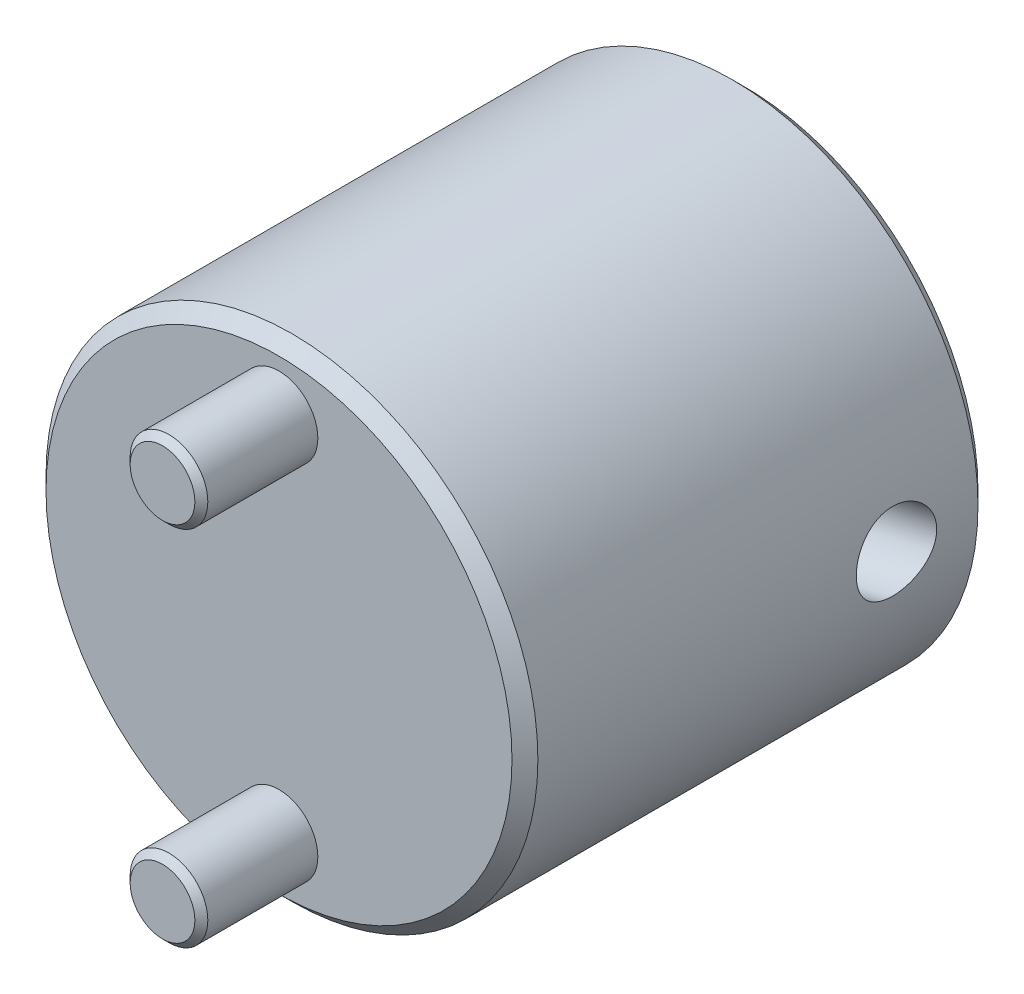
ISO-10303-21;
HEADER;
FILE_DESCRIPTION(('STEP AP214'),'2;1');
FILE_NAME('part.step','',(''),(''),'','','');
FILE_SCHEMA(('AUTOMOTIVE_DESIGN { 1 0 10303 214 1 1 1 1 }'));
ENDSEC;
DATA;
#1=APPLICATION_CONTEXT('core data for automotive mechanical design processes');
#2=APPLICATION_PROTOCOL_DEFINITION('international standard','automotive_design',2000,#1);
#3=PRODUCT_CONTEXT('',#1,'mechanical');
#4=PRODUCT('Part','Part','',(#3));
#5=PRODUCT_RELATED_PRODUCT_CATEGORY('part','',(#4));
#6=PRODUCT_DEFINITION_FORMATION('','',#4);
#7=PRODUCT_DEFINITION_CONTEXT('part definition',#1,'design');
#8=PRODUCT_DEFINITION('design','',#6,#7);
#9=PRODUCT_DEFINITION_SHAPE('','',#8);
#10=(LENGTH_UNIT() NAMED_UNIT(*) SI_UNIT(.MILLI.,.METRE.));
#11=(NAMED_UNIT(*) PLANE_ANGLE_UNIT() SI_UNIT($,.RADIAN.));
#12=(NAMED_UNIT(*) SI_UNIT($,.STERADIAN.) SOLID_ANGLE_UNIT());
#13=UNCERTAINTY_MEASURE_WITH_UNIT(LENGTH_MEASURE(1.E-05),#10,'distance_accuracy_value','');
#14=(GEOMETRIC_REPRESENTATION_CONTEXT(3) GLOBAL_UNCERTAINTY_ASSIGNED_CONTEXT((#13)) GLOBAL_UNIT_ASSIGNED_CONTEXT((#10,
#11,#12)) REPRESENTATION_CONTEXT('',''));
#15=CARTESIAN_POINT('',(0.,0.,0.));
#16=DIRECTION('',(0.,0.,1.));
#17=DIRECTION('',(1.,0.,0.));
#18=AXIS2_PLACEMENT_3D('',#15,#16,#17);
#19=CARTESIAN_POINT('',(0.,0.,9.));
#20=DIRECTION('',(0.,0.,1.));
#21=DIRECTION('',(1.,0.,0.));
#22=AXIS2_PLACEMENT_3D('',#19,#20,#21);
#23=PLANE('',#22);
#24=CARTESIAN_POINT('',(0.,14.,9.));
#25=DIRECTION('',(0.,0.,1.));
#26=DIRECTION('',(1.,0.,0.));
#27=AXIS2_PLACEMENT_3D('',#24,#25,#26);
#28=CIRCLE('',#27,2.49998893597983);
#29=CARTESIAN_POINT('',(2.49998893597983,14.,9.));
#30=VERTEX_POINT('',#29);
#31=EDGE_CURVE('E17',#30,#30,#28,.F.);
#32=ORIENTED_EDGE('',*,*,#31,.F.);
#33=EDGE_LOOP('',(#32));
#34=FACE_BOUND('',#33,.T.);
#35=ADVANCED_FACE('F14',(#34),#23,.T.);
#36=CARTESIAN_POINT('',(0.,0.,9.));
#37=DIRECTION('',(0.,0.,1.));
#38=DIRECTION('',(1.,0.,0.));
#39=AXIS2_PLACEMENT_3D('',#36,#37,#38);
#40=PLANE('',#39);
#41=CARTESIAN_POINT('',(0.,-14.,9.));
#42=DIRECTION('',(0.,0.,1.));
#43=DIRECTION('',(1.,0.,0.));
#44=AXIS2_PLACEMENT_3D('',#41,#42,#43);
#45=CIRCLE('',#44,2.49998893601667);
#46=CARTESIAN_POINT('',(2.49998893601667,-14.,9.));
#47=VERTEX_POINT('',#46);
#48=EDGE_CURVE('E114',#47,#47,#45,.F.);
#49=ORIENTED_EDGE('',*,*,#48,.F.);
#50=EDGE_LOOP('',(#49));
#51=FACE_BOUND('',#50,.T.);
#52=ADVANCED_FACE('F104',(#51),#40,.T.);
#53=CARTESIAN_POINT('',(3.764571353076,0.,-7.022225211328));
#54=DIRECTION('',(0.258819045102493,0.,0.965925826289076));
#55=DIRECTION('',(0.965925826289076,0.,-0.258819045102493));
#56=AXIS2_PLACEMENT_3D('',#53,#54,#55);
#57=PLANE('',#56);
#58=CARTESIAN_POINT('',(3.76457135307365,0.,-7.02222521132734));
#59=DIRECTION('',(0.258819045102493,0.,0.965925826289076));
#60=DIRECTION('',(0.965925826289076,0.,-0.258819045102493));
#61=AXIS2_PLACEMENT_3D('',#58,#59,#60);
#62=CIRCLE('',#61,10.);
#63=CARTESIAN_POINT('',(13.4238296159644,0.,-9.61041566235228));
#64=VERTEX_POINT('',#63);
#65=EDGE_CURVE('E116',#64,#64,#62,.F.);
#66=ORIENTED_EDGE('',*,*,#65,.T.);
#67=EDGE_LOOP('',(#66));
#68=FACE_BOUND('',#67,.T.);
#69=ADVANCED_FACE('F101',(#68),#57,.F.);
#70=CARTESIAN_POINT('',(0.,14.,8.49999144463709));
#71=DIRECTION('',(0.,0.,-1.));
#72=DIRECTION('',(-1.,0.,0.));
#73=AXIS2_PLACEMENT_3D('',#70,#71,#72);
#74=CONICAL_SURFACE('',#73,2.99999527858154,0.785395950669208);
#75=CARTESIAN_POINT('',(0.,14.,8.49998672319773));
#76=DIRECTION('',(0.,0.,-1.));
#77=DIRECTION('',(-1.,0.,0.));
#78=AXIS2_PLACEMENT_3D('',#75,#76,#77);
#79=CIRCLE('',#78,3.);
#80=CARTESIAN_POINT('',(-3.,14.,8.49998672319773));
#81=VERTEX_POINT('',#80);
#82=EDGE_CURVE('E118',#81,#81,#79,.T.);
#83=ORIENTED_EDGE('',*,*,#82,.F.);
#84=EDGE_LOOP('',(#83));
#85=FACE_BOUND('',#84,.T.);
#86=ORIENTED_EDGE('',*,*,#31,.T.);
#87=EDGE_LOOP('',(#86));
#88=FACE_BOUND('',#87,.T.);
#89=ADVANCED_FACE('F97',(#85,#88),#74,.T.);
#90=CARTESIAN_POINT('',(0.,-14.,8.49999144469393));
#91=DIRECTION('',(0.,0.,-1.));
#92=DIRECTION('',(-1.,0.,0.));
#93=AXIS2_PLACEMENT_3D('',#90,#91,#92);
#94=CONICAL_SURFACE('',#93,2.99999527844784,0.785395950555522);
#95=CARTESIAN_POINT('',(0.,-14.,8.49998672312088));
#96=DIRECTION('',(0.,0.,-1.));
#97=DIRECTION('',(-1.,0.,0.));
#98=AXIS2_PLACEMENT_3D('',#95,#96,#97);
#99=CIRCLE('',#98,3.);
#100=CARTESIAN_POINT('',(-3.,-14.,8.49998672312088));
#101=VERTEX_POINT('',#100);
#102=EDGE_CURVE('E123',#101,#101,#99,.T.);
#103=ORIENTED_EDGE('',*,*,#102,.F.);
#104=EDGE_LOOP('',(#103));
#105=FACE_BOUND('',#104,.T.);
#106=ORIENTED_EDGE('',*,*,#48,.T.);
#107=EDGE_LOOP('',(#106));
#108=FACE_BOUND('',#107,.T.);
#109=ADVANCED_FACE('F92',(#105,#108),#94,.T.);
#110=CARTESIAN_POINT('',(-7.817580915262,0.,-50.24740593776));
#111=DIRECTION('',(0.258819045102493,0.,0.965925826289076));
#112=DIRECTION('',(0.965925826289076,0.,-0.258819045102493));
#113=AXIS2_PLACEMENT_3D('',#110,#111,#112);
#114=CYLINDRICAL_SURFACE('',#113,10.);
#115=CARTESIAN_POINT('',(-4.00000000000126,0.,-36.));
#116=DIRECTION('',(0.,0.,-1.));
#117=DIRECTION('',(1.,0.,0.));
#118=AXIS2_PLACEMENT_3D('',#115,#116,#117);
#119=ELLIPSE('',#118,10.3527618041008,10.);
#120=CARTESIAN_POINT('',(6.35276180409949,0.,-36.));
#121=VERTEX_POINT('',#120);
#122=EDGE_CURVE('E79',#121,#121,#119,.F.);
#123=ORIENTED_EDGE('',*,*,#122,.F.);
#124=EDGE_LOOP('',(#123));
#125=FACE_BOUND('',#124,.T.);
#126=ORIENTED_EDGE('',*,*,#65,.F.);
#127=EDGE_LOOP('',(#126));
#128=FACE_BOUND('',#127,.T.);
#129=CARTESIAN_POINT('',(8.24744871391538,0.,-28.9289321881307));
#130=CARTESIAN_POINT('',(8.24744530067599,0.16436423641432,-28.9289220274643));
#131=CARTESIAN_POINT('',(8.24700357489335,0.328908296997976,-28.914764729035));
#132=CARTESIAN_POINT('',(8.24553188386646,0.653366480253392,-28.8586597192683));
#133=CARTESIAN_POINT('',(8.24450088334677,0.813271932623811,-28.8166630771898));
#134=CARTESIAN_POINT('',(8.24273088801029,1.12348315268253,-28.7066357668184));
#135=CARTESIAN_POINT('',(8.24199129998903,1.27380789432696,-28.6386585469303));
#136=CARTESIAN_POINT('',(8.24212053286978,1.56129290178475,-28.4791267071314));
#137=CARTESIAN_POINT('',(8.2429890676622,1.69845550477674,-28.3875762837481));
#138=CARTESIAN_POINT('',(8.2480224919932,1.95973946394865,-28.1811555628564));
#139=CARTESIAN_POINT('',(8.25227246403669,2.08342924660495,-28.065741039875));
#140=CARTESIAN_POINT('',(8.26608322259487,2.31049290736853,-27.8166435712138));
#141=CARTESIAN_POINT('',(8.27564519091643,2.41386225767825,-27.6829565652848));
#142=CARTESIAN_POINT('',(8.30223099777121,2.59960101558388,-27.3980038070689));
#143=CARTESIAN_POINT('',(8.31941758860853,2.68144668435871,-27.2464107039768));
#144=CARTESIAN_POINT('',(8.3628878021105,2.81842825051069,-26.9328144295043));
#145=CARTESIAN_POINT('',(8.3891691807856,2.87357072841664,-26.7708138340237));
#146=CARTESIAN_POINT('',(8.45077810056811,2.95403265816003,-26.4461794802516));
#147=CARTESIAN_POINT('',(8.48583175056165,2.98014390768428,-26.283690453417));
#148=CARTESIAN_POINT('',(8.56503701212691,3.00427461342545,-25.9588611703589));
#149=CARTESIAN_POINT('',(8.60918642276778,3.00230085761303,-25.7965208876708));
#150=CARTESIAN_POINT('',(8.70341728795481,2.9709395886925,-25.48275243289));
#151=CARTESIAN_POINT('',(8.75322706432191,2.94254427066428,-25.3311418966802));
#152=CARTESIAN_POINT('',(8.85781258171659,2.86074869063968,-25.0366406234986));
#153=CARTESIAN_POINT('',(8.91258883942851,2.80734582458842,-24.8937507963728));
#154=CARTESIAN_POINT('',(9.02512371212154,2.67631861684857,-24.6181167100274));
#155=CARTESIAN_POINT('',(9.08291294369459,2.59837186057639,-24.4855386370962));
#156=CARTESIAN_POINT('',(9.19760751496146,2.42069837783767,-24.2354532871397));
#157=CARTESIAN_POINT('',(9.25451269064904,2.32096766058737,-24.117948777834));
#158=CARTESIAN_POINT('',(9.36648870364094,2.09764727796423,-23.8957085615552));
#159=CARTESIAN_POINT('',(9.42138474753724,1.97323765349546,-23.7917074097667));
#160=CARTESIAN_POINT('',(9.52318743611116,1.70657662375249,-23.6046220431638));
#161=CARTESIAN_POINT('',(9.57009064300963,1.56431758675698,-23.5215468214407));
#162=CARTESIAN_POINT('',(9.65297105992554,1.26458300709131,-23.3777651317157));
#163=CARTESIAN_POINT('',(9.68886464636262,1.10700242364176,-23.3172291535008));
#164=CARTESIAN_POINT('',(9.74650103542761,0.782158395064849,-23.2211539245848));
#165=CARTESIAN_POINT('',(9.76827302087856,0.614915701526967,-23.1855631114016));
#166=CARTESIAN_POINT('',(9.78820464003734,0.371824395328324,-23.1530972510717));
#167=CARTESIAN_POINT('',(9.79275497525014,0.297737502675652,-23.1457094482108));
#168=CARTESIAN_POINT('',(9.79883597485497,0.149112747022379,-23.135847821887));
#169=CARTESIAN_POINT('',(9.80036663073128,0.074574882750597,-23.1333740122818));
#170=CARTESIAN_POINT('',(9.80035494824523,-0.164364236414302,-23.1333843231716));
#171=CARTESIAN_POINT('',(9.79289375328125,-0.328908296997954,-23.145424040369));
#172=CARTESIAN_POINT('',(9.76356672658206,-0.653366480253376,-23.1932765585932));
#173=CARTESIAN_POINT('',(9.74167553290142,-0.813271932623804,-23.229131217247));
#174=CARTESIAN_POINT('',(9.6851290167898,-1.12348315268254,-23.3235326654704));
#175=CARTESIAN_POINT('',(9.650499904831,-1.27380789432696,-23.3820328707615));
#176=CARTESIAN_POINT('',(9.5708459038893,-1.56129290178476,-23.5202561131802));
#177=CARTESIAN_POINT('',(9.52582286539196,-1.69845550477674,-23.5999753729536));
#178=CARTESIAN_POINT('',(9.42697157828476,-1.95973946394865,-23.7812576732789));
#179=CARTESIAN_POINT('',(9.3729449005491,-2.08342924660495,-23.8833345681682));
#180=CARTESIAN_POINT('',(9.26035663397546,-2.31049290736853,-24.1059646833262));
#181=CARTESIAN_POINT('',(9.20179403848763,-2.41386225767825,-24.2265220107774));
#182=CARTESIAN_POINT('',(9.08234164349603,-2.59960101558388,-24.4865912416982));
#183=CARTESIAN_POINT('',(9.02142911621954,-2.68144668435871,-24.6264680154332));
#184=CARTESIAN_POINT('',(8.90227728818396,-2.81842825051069,-24.9197854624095));
#185=CARTESIAN_POINT('',(8.84403733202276,-2.87357072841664,-25.0732227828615));
#186=CARTESIAN_POINT('',(8.73507504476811,-2.95403265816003,-25.3851688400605));
#187=CARTESIAN_POINT('',(8.68418788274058,-2.98014390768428,-25.5434152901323));
#188=CARTESIAN_POINT('',(8.59036700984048,-3.00427461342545,-25.8643283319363));
#189=CARTESIAN_POINT('',(8.54743137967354,-3.00230085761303,-26.0269938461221));
#190=CARTESIAN_POINT('',(8.47215347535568,-2.9709395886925,-26.3458407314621));
#191=CARTESIAN_POINT('',(8.43948473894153,-2.94254427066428,-26.5020441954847));
#192=CARTESIAN_POINT('',(8.38280781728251,-2.86074869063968,-26.8093825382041));
#193=CARTESIAN_POINT('',(8.35880053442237,-2.80734582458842,-26.9605168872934));
#194=CARTESIAN_POINT('',(8.31844154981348,-2.67631861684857,-27.255490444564));
#195=CARTESIAN_POINT('',(8.30219945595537,-2.59837186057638,-27.3992010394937));
#196=CARTESIAN_POINT('',(8.27648519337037,-2.42069837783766,-27.6731285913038));
#197=CARTESIAN_POINT('',(8.26701426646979,-2.32096766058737,-27.8033430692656));
#198=CARTESIAN_POINT('',(8.25286823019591,-2.09764727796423,-28.0517967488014));
#199=CARTESIAN_POINT('',(8.24840902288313,-1.97323765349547,-28.1693124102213));
#200=CARTESIAN_POINT('',(8.24303005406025,-1.7065766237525,-28.3822344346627));
#201=CARTESIAN_POINT('',(8.24211181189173,-1.56431758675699,-28.4776312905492));
#202=CARTESIAN_POINT('',(8.24199751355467,-1.26458300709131,-28.643590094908));
#203=CARTESIAN_POINT('',(8.24281428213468,-1.10700242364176,-28.7139625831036));
#204=CARTESIAN_POINT('',(8.24469124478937,-0.782158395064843,-28.8259843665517));
#205=CARTESIAN_POINT('',(8.2457509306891,-0.614915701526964,-28.8676929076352));
#206=CARTESIAN_POINT('',(8.24677928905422,-0.371824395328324,-28.905774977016));
#207=CARTESIAN_POINT('',(8.24702609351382,-0.297737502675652,-28.9144481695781));
#208=CARTESIAN_POINT('',(8.24736158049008,-0.149112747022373,-28.9260290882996));
#209=CARTESIAN_POINT('',(8.24745026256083,-0.0745748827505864,-28.9289367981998));
#210=CARTESIAN_POINT('',(8.24744871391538,0.,-28.9289321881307));
#211=B_SPLINE_CURVE_WITH_KNOTS('',3,(#129,#130,#131,#132,#133,#134,#135,#136,#137,#138,#139,
#140,#141,#142,#143,#144,#145,#146,#147,#148,#149,#150,#151,#152,#153,#154,#155,#156,#157,#158,
#159,#160,#161,#162,#163,#164,#165,#166,#167,#168,#169,#170,#171,#172,#173,#174,#175,#176,#177,
#178,#179,#180,#181,#182,#183,#184,#185,#186,#187,#188,#189,#190,#191,#192,#193,#194,#195,#196,
#197,#198,#199,#200,#201,#202,#203,#204,#205,#206,#207,#208,#209,#210),.UNSPECIFIED.,.T.,.F.,(4,
2,2,2,2,2,2,2,2,2,2,2,2,2,2,2,2,2,2,2,2,2,2,2,2,2,2,2,2,2,2,2,2,2,2,2,2,2,2,2,4),(0.,
0.49280574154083,0.986479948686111,1.47914396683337,1.97172034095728,2.47709830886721,
2.98258875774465,3.49943124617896,4.01614630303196,4.51839363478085,5.02051957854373,
5.50451902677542,5.98856888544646,6.47926306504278,6.97004721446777,7.48124851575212,
7.99266913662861,8.507883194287,9.02202912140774,9.2456229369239,9.46921738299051,
9.96202312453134,10.4556973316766,10.9483613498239,11.4409377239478,11.9463156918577,
12.4518061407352,12.9686486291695,13.4853636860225,13.9876110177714,14.4897369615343,
14.9737364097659,15.457786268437,15.9484804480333,16.4392645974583,16.9504658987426,
17.4618865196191,17.9771005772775,18.4912465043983,18.7148403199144,18.938434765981),.UNSPECIFIED.);
#212=CARTESIAN_POINT('',(8.24744871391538,0.,-28.9289321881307));
#213=VERTEX_POINT('',#212);
#214=EDGE_CURVE('E76',#213,#213,#211,.T.);
#215=ORIENTED_EDGE('',*,*,#214,.T.);
#216=EDGE_LOOP('',(#215));
#217=FACE_BOUND('',#216,.T.);
#218=ADVANCED_FACE('F86',(#125,#128,#217),#114,.F.);
#219=CARTESIAN_POINT('',(0.,14.,0.));
#220=DIRECTION('',(0.,0.,1.));
#221=DIRECTION('',(1.,0.,0.));
#222=AXIS2_PLACEMENT_3D('',#219,#220,#221);
#223=CYLINDRICAL_SURFACE('',#222,3.);
#224=CARTESIAN_POINT('',(0.,14.,0.));
#225=DIRECTION('',(0.,0.,1.));
#226=DIRECTION('',(1.,0.,0.));
#227=AXIS2_PLACEMENT_3D('',#224,#225,#226);
#228=CIRCLE('',#227,3.);
#229=CARTESIAN_POINT('',(3.,14.,0.));
#230=VERTEX_POINT('',#229);
#231=EDGE_CURVE('E72',#230,#230,#228,.T.);
#232=ORIENTED_EDGE('',*,*,#231,.T.);
#233=EDGE_LOOP('',(#232));
#234=FACE_BOUND('',#233,.T.);
#235=ORIENTED_EDGE('',*,*,#82,.T.);
#236=EDGE_LOOP('',(#235));
#237=FACE_BOUND('',#236,.T.);
#238=ADVANCED_FACE('F91',(#234,#237),#223,.T.);
#239=CARTESIAN_POINT('',(0.,-14.,0.));
#240=DIRECTION('',(0.,0.,1.));
#241=DIRECTION('',(1.,0.,0.));
#242=AXIS2_PLACEMENT_3D('',#239,#240,#241);
#243=CYLINDRICAL_SURFACE('',#242,3.);
#244=CARTESIAN_POINT('',(0.,-14.,0.));
#245=DIRECTION('',(0.,0.,1.));
#246=DIRECTION('',(1.,0.,0.));
#247=AXIS2_PLACEMENT_3D('',#244,#245,#246);
#248=CIRCLE('',#247,3.);
#249=CARTESIAN_POINT('',(3.,-14.,0.));
#250=VERTEX_POINT('',#249);
#251=EDGE_CURVE('E68',#250,#250,#248,.T.);
#252=ORIENTED_EDGE('',*,*,#251,.T.);
#253=EDGE_LOOP('',(#252));
#254=FACE_BOUND('',#253,.T.);
#255=ORIENTED_EDGE('',*,*,#102,.T.);
#256=EDGE_LOOP('',(#255));
#257=FACE_BOUND('',#256,.T.);
#258=ADVANCED_FACE('F139',(#254,#257),#243,.T.);
#259=CARTESIAN_POINT('',(0.,0.,-36.));
#260=DIRECTION('',(0.,0.,-1.));
#261=DIRECTION('',(-1.,0.,0.));
#262=AXIS2_PLACEMENT_3D('',#259,#260,#261);
#263=PLANE('',#262);
#264=ORIENTED_EDGE('',*,*,#122,.T.);
#265=EDGE_LOOP('',(#264));
#266=FACE_BOUND('',#265,.T.);
#267=CARTESIAN_POINT('',(0.,0.,-36.));
#268=DIRECTION('',(0.,0.,-1.));
#269=DIRECTION('',(-1.,0.,0.));
#270=AXIS2_PLACEMENT_3D('',#267,#268,#269);
#271=CIRCLE('',#270,17.9999935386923);
#272=CARTESIAN_POINT('',(-17.9999935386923,0.,-36.));
#273=VERTEX_POINT('',#272);
#274=EDGE_CURVE('E38',#273,#273,#271,.F.);
#275=ORIENTED_EDGE('',*,*,#274,.F.);
#276=EDGE_LOOP('',(#275));
#277=FACE_BOUND('',#276,.T.);
#278=ADVANCED_FACE('F63',(#266,#277),#263,.T.);
#279=CARTESIAN_POINT('',(-5.899648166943,0.,-22.03240046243));
#280=DIRECTION('',(0.965925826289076,0.,-0.258819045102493));
#281=DIRECTION('',(-0.258819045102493,0.,-0.965925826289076));
#282=AXIS2_PLACEMENT_3D('',#279,#280,#281);
#283=CYLINDRICAL_SURFACE('',#282,3.);
#284=ORIENTED_EDGE('',*,*,#214,.F.);
#285=EDGE_LOOP('',(#284));
#286=FACE_BOUND('',#285,.T.);
#287=CARTESIAN_POINT('',(19.,0.,-25.5984125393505));
#288=CARTESIAN_POINT('',(18.9999969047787,0.167403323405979,-25.5984196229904));
#289=CARTESIAN_POINT('',(18.9977630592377,0.335008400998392,-25.612377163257));
#290=CARTESIAN_POINT('',(18.9890583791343,0.665690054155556,-25.6679195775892));
#291=CARTESIAN_POINT('',(18.982579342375,0.828757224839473,-25.7095579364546));
#292=CARTESIAN_POINT('',(18.9661054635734,1.14540627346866,-25.8193796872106));
#293=CARTESIAN_POINT('',(18.9561131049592,1.29899476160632,-25.8875443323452));
#294=CARTESIAN_POINT('',(18.9337295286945,1.59234146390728,-26.0485681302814));
#295=CARTESIAN_POINT('',(18.9213393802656,1.73210580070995,-26.1414162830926));
#296=CARTESIAN_POINT('',(18.8955514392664,1.99385296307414,-26.3492056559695));
#297=CARTESIAN_POINT('',(18.8821543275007,2.11584764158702,-26.4641320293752));
#298=CARTESIAN_POINT('',(18.8558383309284,2.33880275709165,-26.7128902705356));
#299=CARTESIAN_POINT('',(18.8429194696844,2.43976215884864,-26.8467230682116));
#300=CARTESIAN_POINT('',(18.8189581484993,2.61819933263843,-27.129762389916));
#301=CARTESIAN_POINT('',(18.8079197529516,2.69562651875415,-27.2790011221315));
#302=CARTESIAN_POINT('',(18.7889355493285,2.82492340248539,-27.5883331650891));
#303=CARTESIAN_POINT('',(18.7809898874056,2.8767918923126,-27.748426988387));
#304=CARTESIAN_POINT('',(18.7688938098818,2.95469464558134,-28.0776267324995));
#305=CARTESIAN_POINT('',(18.7648064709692,2.98030011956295,-28.2468361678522));
#306=CARTESIAN_POINT('',(18.7610078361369,3.00411803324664,-28.5872107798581));
#307=CARTESIAN_POINT('',(18.7612973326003,3.0023255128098,-28.7583763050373));
#308=CARTESIAN_POINT('',(18.7662208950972,2.97139828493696,-29.1042359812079));
#309=CARTESIAN_POINT('',(18.7710077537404,2.94130195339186,-29.2788418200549));
#310=CARTESIAN_POINT('',(18.7845425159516,2.85357888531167,-29.620847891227));
#311=CARTESIAN_POINT('',(18.7932914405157,2.79594505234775,-29.7882462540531));
#312=CARTESIAN_POINT('',(18.8141342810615,2.65213129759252,-30.1173811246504));
#313=CARTESIAN_POINT('',(18.8263377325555,2.56499432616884,-30.278693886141));
#314=CARTESIAN_POINT('',(18.8525130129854,2.36493533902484,-30.5842893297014));
#315=CARTESIAN_POINT('',(18.866484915,2.2520122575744,-30.7285713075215));
#316=CARTESIAN_POINT('',(18.894533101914,2.00304576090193,-30.9952876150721));
#317=CARTESIAN_POINT('',(18.9086091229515,1.86704892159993,-31.117764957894));
#318=CARTESIAN_POINT('',(18.9285076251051,1.64832999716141,-31.2817460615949));
#319=CARTESIAN_POINT('',(18.9349419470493,1.57291180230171,-31.3331463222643));
#320=CARTESIAN_POINT('',(18.9471975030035,1.41765849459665,-31.4288325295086));
#321=CARTESIAN_POINT('',(18.9530190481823,1.33782565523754,-31.4731220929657));
#322=CARTESIAN_POINT('',(18.9635405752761,1.17902317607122,-31.5517419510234));
#323=CARTESIAN_POINT('',(18.9682857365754,1.10026669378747,-31.5864977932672));
#324=CARTESIAN_POINT('',(18.9769052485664,0.939949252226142,-31.6488178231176));
#325=CARTESIAN_POINT('',(18.9807800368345,0.858389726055,-31.6763856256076));
#326=CARTESIAN_POINT('',(18.9875277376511,0.693256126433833,-31.7239563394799));
#327=CARTESIAN_POINT('',(18.9904029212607,0.609687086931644,-31.7439764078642));
#328=CARTESIAN_POINT('',(18.9950666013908,0.441076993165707,-31.7762731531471));
#329=CARTESIAN_POINT('',(18.9968557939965,0.356036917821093,-31.7885547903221));
#330=CARTESIAN_POINT('',(18.9987131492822,0.225661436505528,-31.8012786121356));
#331=CARTESIAN_POINT('',(18.9991950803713,0.180594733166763,-31.8045732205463));
#332=CARTESIAN_POINT('',(18.9998389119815,0.0903584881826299,-31.808970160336));
#333=CARTESIAN_POINT('',(19.0000008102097,0.0451889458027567,-31.8100724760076));
#334=CARTESIAN_POINT('',(18.9999971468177,-0.15913449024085,-31.8100595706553));
#335=CARTESIAN_POINT('',(18.9979765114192,-0.318509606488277,-31.796344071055));
#336=CARTESIAN_POINT('',(18.9901155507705,-0.632732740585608,-31.742042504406));
#337=CARTESIAN_POINT('',(18.9842665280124,-0.787569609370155,-31.7013952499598));
#338=CARTESIAN_POINT('',(18.9694319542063,-1.08773614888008,-31.5951397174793));
#339=CARTESIAN_POINT('',(18.9604556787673,-1.23309244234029,-31.529605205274));
#340=CARTESIAN_POINT('',(18.940323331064,-1.51116527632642,-31.3761513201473));
#341=CARTESIAN_POINT('',(18.9291678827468,-1.64388541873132,-31.2882383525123));
#342=CARTESIAN_POINT('',(18.905305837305,-1.89908311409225,-31.088960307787));
#343=CARTESIAN_POINT('',(18.8925545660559,-2.02092324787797,-30.9767858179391));
#344=CARTESIAN_POINT('',(18.8671708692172,-2.24558997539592,-30.734765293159));
#345=CARTESIAN_POINT('',(18.8545384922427,-2.34840908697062,-30.6049123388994));
#346=CARTESIAN_POINT('',(18.8297428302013,-2.53984120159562,-30.320952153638));
#347=CARTESIAN_POINT('',(18.8176809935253,-2.62687066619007,-30.1657666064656));
#348=CARTESIAN_POINT('',(18.7964299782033,-2.77485644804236,-29.8432204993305));
#349=CARTESIAN_POINT('',(18.7872415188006,-2.83580623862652,-29.6758569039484));
#350=CARTESIAN_POINT('',(18.7725277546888,-2.93166609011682,-29.3271949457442));
#351=CARTESIAN_POINT('',(18.7671446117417,-2.96557112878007,-29.1456125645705));
#352=CARTESIAN_POINT('',(18.761316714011,-3.00222499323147,-28.7792346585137));
#353=CARTESIAN_POINT('',(18.7608715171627,-3.00497660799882,-28.5944394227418));
#354=CARTESIAN_POINT('',(18.765046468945,-2.97879139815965,-28.23039802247));
#355=CARTESIAN_POINT('',(18.7695778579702,-2.9504098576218,-28.051111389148));
#356=CARTESIAN_POINT('',(18.7831129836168,-2.86297217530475,-27.7003511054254));
#357=CARTESIAN_POINT('',(18.7921156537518,-2.80392334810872,-27.5288756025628));
#358=CARTESIAN_POINT('',(18.8130991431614,-2.65939364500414,-27.2059597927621));
#359=CARTESIAN_POINT('',(18.8249452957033,-2.57507410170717,-27.0539905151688));
#360=CARTESIAN_POINT('',(18.8504098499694,-2.3814987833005,-26.7670471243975));
#361=CARTESIAN_POINT('',(18.8640278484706,-2.27224867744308,-26.6320691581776));
#362=CARTESIAN_POINT('',(18.891050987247,-2.03519079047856,-26.3866043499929));
#363=CARTESIAN_POINT('',(18.904451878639,-1.90796690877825,-26.2755524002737));
#364=CARTESIAN_POINT('',(18.929892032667,-1.63638363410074,-26.0765246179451));
#365=CARTESIAN_POINT('',(18.9419307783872,-1.49201777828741,-25.9885575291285));
#366=CARTESIAN_POINT('',(18.9632048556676,-1.19139303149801,-25.8386976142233));
#367=CARTESIAN_POINT('',(18.9724583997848,-1.03522014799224,-25.7766343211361));
#368=CARTESIAN_POINT('',(18.9872251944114,-0.714757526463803,-25.6794636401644));
#369=CARTESIAN_POINT('',(18.992745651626,-0.550484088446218,-25.6443042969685));
#370=CARTESIAN_POINT('',(18.9973992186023,-0.320831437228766,-25.6148070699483));
#371=CARTESIAN_POINT('',(18.998372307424,-0.256831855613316,-25.6086637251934));
#372=CARTESIAN_POINT('',(18.9996732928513,-0.128564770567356,-25.6004650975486));
#373=CARTESIAN_POINT('',(19.0000011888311,-0.0642972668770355,-25.5984098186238));
#374=CARTESIAN_POINT('',(19.,0.,-25.5984125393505));
#375=B_SPLINE_CURVE_WITH_KNOTS('',3,(#287,#288,#289,#290,#291,#292,#293,#294,#295,#296,#297,
#298,#299,#300,#301,#302,#303,#304,#305,#306,#307,#308,#309,#310,#311,#312,#313,#314,#315,#316,
#317,#318,#319,#320,#321,#322,#323,#324,#325,#326,#327,#328,#329,#330,#331,#332,#333,#334,#335,
#336,#337,#338,#339,#340,#341,#342,#343,#344,#345,#346,#347,#348,#349,#350,#351,#352,#353,#354,
#355,#356,#357,#358,#359,#360,#361,#362,#363,#364,#365,#366,#367,#368,#369,#370,#371,#372,#373,
#374),.UNSPECIFIED.,.T.,.F.,(4,2,2,2,2,2,2,2,2,2,2,2,2,2,2,2,2,2,2,2,2,2,2,2,2,2,2,2,2,2,2,2,2,
2,2,2,2,2,2,2,2,2,2,4),(0.,0.501968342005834,1.00490941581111,1.50749569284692,2.00985837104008,
2.51188440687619,3.01393514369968,3.51705760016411,4.02020382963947,4.53143998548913,
5.04276869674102,5.5721224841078,6.10161275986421,6.65025335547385,7.19891663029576,
7.74648528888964,8.02065360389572,8.29468201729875,8.55299192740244,8.81117168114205,
9.06876096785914,9.3261849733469,9.46170177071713,9.59721953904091,10.074450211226,
10.5527688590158,11.0296806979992,11.5064561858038,12.0026522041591,12.499042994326,
13.0316460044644,13.5643822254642,14.1160972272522,14.6677628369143,15.2097467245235,
15.7516014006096,16.2716155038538,16.7915114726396,17.297302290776,17.8032844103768,
18.3058821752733,18.8075068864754,19.0003056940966,19.1931046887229),.UNSPECIFIED.);
#376=CARTESIAN_POINT('',(19.,0.,-25.5984125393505));
#377=VERTEX_POINT('',#376);
#378=EDGE_CURVE('E31',#377,#377,#375,.T.);
#379=ORIENTED_EDGE('',*,*,#378,.F.);
#380=EDGE_LOOP('',(#379));
#381=FACE_BOUND('',#380,.T.);
#382=ADVANCED_FACE('F40',(#286,#381),#283,.F.);
#383=CARTESIAN_POINT('',(0.,0.,0.));
#384=DIRECTION('',(0.,0.,-1.));
#385=DIRECTION('',(-1.,0.,0.));
#386=AXIS2_PLACEMENT_3D('',#383,#384,#385);
#387=PLANE('',#386);
#388=ORIENTED_EDGE('',*,*,#251,.F.);
#389=EDGE_LOOP('',(#388));
#390=FACE_BOUND('',#389,.T.);
#391=ORIENTED_EDGE('',*,*,#231,.F.);
#392=EDGE_LOOP('',(#391));
#393=FACE_BOUND('',#392,.T.);
#394=CARTESIAN_POINT('',(0.,0.,0.));
#395=DIRECTION('',(0.,0.,-1.));
#396=DIRECTION('',(-1.,0.,0.));
#397=AXIS2_PLACEMENT_3D('',#394,#395,#396);
#398=CIRCLE('',#397,17.9999934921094);
#399=CARTESIAN_POINT('',(-17.9999934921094,0.,0.));
#400=VERTEX_POINT('',#399);
#401=EDGE_CURVE('E26',#400,#400,#398,.T.);
#402=ORIENTED_EDGE('',*,*,#401,.F.);
#403=EDGE_LOOP('',(#402));
#404=FACE_BOUND('',#403,.T.);
#405=ADVANCED_FACE('F55',(#390,#393,#404),#387,.F.);
#406=CARTESIAN_POINT('',(0.,0.,-34.99999620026));
#407=DIRECTION('',(0.,0.,1.));
#408=DIRECTION('',(1.,0.,0.));
#409=AXIS2_PLACEMENT_3D('',#406,#407,#408);
#410=CONICAL_SURFACE('',#409,18.9999969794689,0.785397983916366);
#411=ORIENTED_EDGE('',*,*,#274,.T.);
#412=EDGE_LOOP('',(#411));
#413=FACE_BOUND('',#412,.T.);
#414=CARTESIAN_POINT('',(0.,0.,-34.99999922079));
#415=DIRECTION('',(0.,0.,-1.));
#416=DIRECTION('',(-1.,0.,0.));
#417=AXIS2_PLACEMENT_3D('',#414,#415,#416);
#418=CIRCLE('',#417,19.);
#419=CARTESIAN_POINT('',(-19.,0.,-34.99999922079));
#420=VERTEX_POINT('',#419);
#421=EDGE_CURVE('E21',#420,#420,#418,.F.);
#422=ORIENTED_EDGE('',*,*,#421,.F.);
#423=EDGE_LOOP('',(#422));
#424=FACE_BOUND('',#423,.T.);
#425=ADVANCED_FACE('F52',(#413,#424),#410,.T.);
#426=CARTESIAN_POINT('',(0.,0.,-1.00000391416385));
#427=DIRECTION('',(0.,0.,-1.));
#428=DIRECTION('',(-1.,0.,0.));
#429=AXIS2_PLACEMENT_3D('',#426,#427,#428);
#430=CONICAL_SURFACE('',#429,18.9999970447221,0.785397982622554);
#431=CARTESIAN_POINT('',(0.,0.,-1.000000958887));
#432=DIRECTION('',(0.,0.,-1.));
#433=DIRECTION('',(-1.,0.,0.));
#434=AXIS2_PLACEMENT_3D('',#431,#432,#433);
#435=CIRCLE('',#434,19.);
#436=CARTESIAN_POINT('',(-19.,0.,-1.000000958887));
#437=VERTEX_POINT('',#436);
#438=EDGE_CURVE('E9',#437,#437,#435,.T.);
#439=ORIENTED_EDGE('',*,*,#438,.F.);
#440=EDGE_LOOP('',(#439));
#441=FACE_BOUND('',#440,.T.);
#442=ORIENTED_EDGE('',*,*,#401,.T.);
#443=EDGE_LOOP('',(#442));
#444=FACE_BOUND('',#443,.T.);
#445=ADVANCED_FACE('F48',(#441,#444),#430,.T.);
#446=CARTESIAN_POINT('',(0.,0.,1.8));
#447=DIRECTION('',(0.,0.,-1.));
#448=DIRECTION('',(-1.,0.,0.));
#449=AXIS2_PLACEMENT_3D('',#446,#447,#448);
#450=CYLINDRICAL_SURFACE('',#449,19.);
#451=ORIENTED_EDGE('',*,*,#421,.T.);
#452=EDGE_LOOP('',(#451));
#453=FACE_BOUND('',#452,.T.);
#454=ORIENTED_EDGE('',*,*,#438,.T.);
#455=EDGE_LOOP('',(#454));
#456=FACE_BOUND('',#455,.T.);
#457=ORIENTED_EDGE('',*,*,#378,.T.);
#458=EDGE_LOOP('',(#457));
#459=FACE_BOUND('',#458,.T.);
#460=ADVANCED_FACE('F44',(#453,#456,#459),#450,.T.);
#461=CLOSED_SHELL('',(#35,#52,#69,#89,#109,#218,#238,#258,#278,#382,#405,#425,#445,#460));
#462=MANIFOLD_SOLID_BREP('B1',#461);
#463=ADVANCED_BREP_SHAPE_REPRESENTATION('',(#18,#462),#14);
#464=SHAPE_DEFINITION_REPRESENTATION(#9,#463);
ENDSEC;
END-ISO-10303-21;
